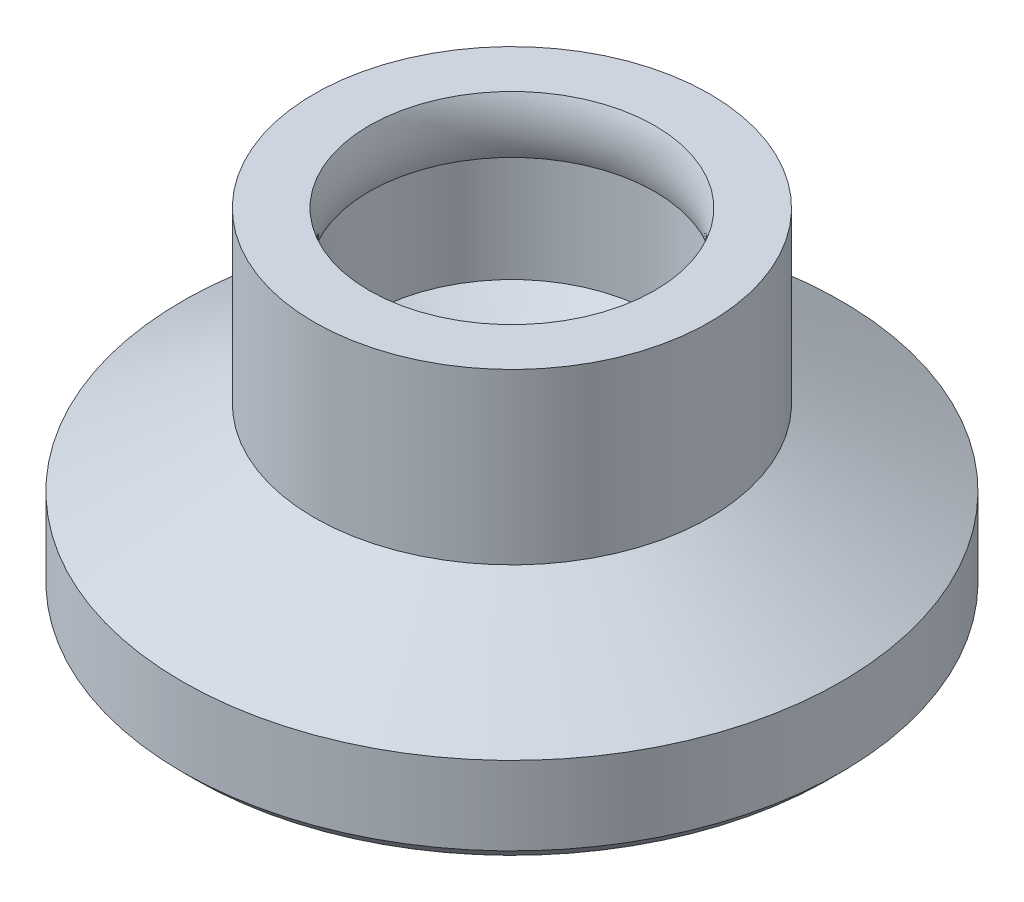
from build123d import *

# Parameters (mm, degrees)
SKETCH1_R      = 5.4
EXTRUDE1_DEPTH = 4.6
SKETCH3_R      = 9
EXTRUDE2_DEPTH = 2.5
CHAMFER1_SIZE  = 0.36


with BuildPart() as part:
    # Sketch1 → Extrude1 (new, symmetric)
    with BuildSketch(Plane(origin=(0, 0, 0), x_dir=(1, 0, 0), z_dir=(0, 1, 0))):
        with Locations(Location((0, 0, 0), (0, 0, 270))):
            Circle(SKETCH1_R)
    extrude(amount=EXTRUDE1_DEPTH, both=True)

    # Sketch3 → Extrude2 (add)
    with BuildSketch(Plane.XZ.offset(4.6)):
        with Locations(Location((0, 0, 0), (0, 0, 270))):
            Circle(SKETCH3_R)
    extrude(amount=-EXTRUDE2_DEPTH)

    # Sketch4 → Revolve1 (revolve)
    with BuildSketch(Plane.XY, mode=Mode.PRIVATE) as revolve1_sk:
        Polygon((-9, -2.1), (-5.4, -0.021539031), (-5.4, -2.1), align=None)
    revolve(revolve1_sk.sketch.rotate(Axis((0, 4.6, 0), (0, -1, 0)), 270), axis=Axis((0, 4.6, 0), (0, -1, 0)))

    # Chamfer1
    chamfer1_edges = [part.edges().sort_by_distance(p)[0] for p in [
        (0, -4.6, 9),
    ]]
    chamfer(chamfer1_edges, length=CHAMFER1_SIZE)

    # Sketch5 → Cut-Revolve1 (revolve, cut)
    with BuildSketch(Plane.XY, mode=Mode.PRIVATE) as cut_revolve1_sk:
        with BuildLine():
            Line((0, 4.6), (3.9, 4.6))
            ThreePointArc((3.9, 4.6), (3.744, 3.82), (3.9, 3.04))
            Line((3.9, 3.04), (3.9, 0.15166605))
            Line((3.9, 0.15166605), (0, -2.1))
            Line((0, -2.1), (0, 4.6))
        make_face()
    revolve(cut_revolve1_sk.sketch.rotate(Axis((0, 0, 0), (0, 1, 0)), 270), axis=Axis((0, 0, 0), (0, 1, 0)), mode=Mode.SUBTRACT)


solid = part.part
